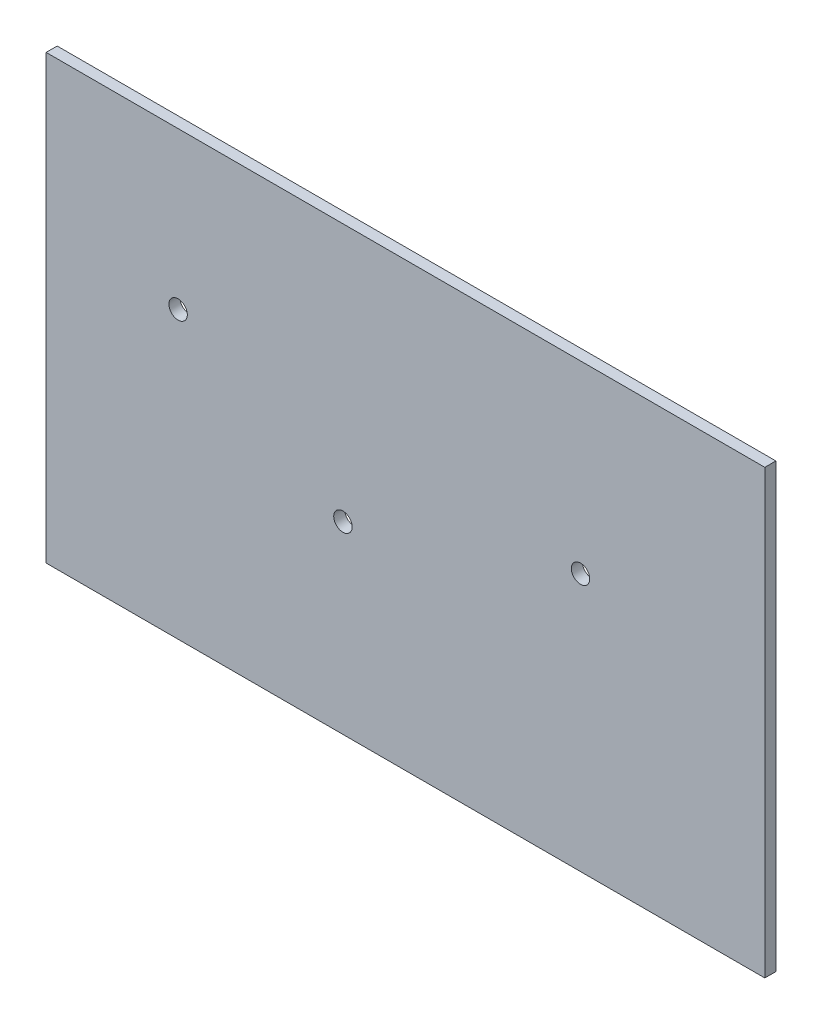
ISO-10303-21;
HEADER;
FILE_DESCRIPTION(('STEP AP214'),'2;1');
FILE_NAME('part.step','',(''),(''),'','','');
FILE_SCHEMA(('AUTOMOTIVE_DESIGN { 1 0 10303 214 1 1 1 1 }'));
ENDSEC;
DATA;
#1=APPLICATION_CONTEXT('core data for automotive mechanical design processes');
#2=APPLICATION_PROTOCOL_DEFINITION('international standard','automotive_design',2000,#1);
#3=PRODUCT_CONTEXT('',#1,'mechanical');
#4=PRODUCT('Part','Part','',(#3));
#5=PRODUCT_RELATED_PRODUCT_CATEGORY('part','',(#4));
#6=PRODUCT_DEFINITION_FORMATION('','',#4);
#7=PRODUCT_DEFINITION_CONTEXT('part definition',#1,'design');
#8=PRODUCT_DEFINITION('design','',#6,#7);
#9=PRODUCT_DEFINITION_SHAPE('','',#8);
#10=(LENGTH_UNIT() NAMED_UNIT(*) SI_UNIT(.MILLI.,.METRE.));
#11=(NAMED_UNIT(*) PLANE_ANGLE_UNIT() SI_UNIT($,.RADIAN.));
#12=(NAMED_UNIT(*) SI_UNIT($,.STERADIAN.) SOLID_ANGLE_UNIT());
#13=UNCERTAINTY_MEASURE_WITH_UNIT(LENGTH_MEASURE(1.E-05),#10,'distance_accuracy_value','');
#14=(GEOMETRIC_REPRESENTATION_CONTEXT(3) GLOBAL_UNCERTAINTY_ASSIGNED_CONTEXT((#13)) GLOBAL_UNIT_ASSIGNED_CONTEXT((#10,
#11,#12)) REPRESENTATION_CONTEXT('',''));
#15=CARTESIAN_POINT('',(0.,0.,0.));
#16=DIRECTION('',(0.,0.,1.));
#17=DIRECTION('',(1.,0.,0.));
#18=AXIS2_PLACEMENT_3D('',#15,#16,#17);
#19=CARTESIAN_POINT('',(-75.7745027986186,50.7636179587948,3.));
#20=DIRECTION('',(1.,0.,0.));
#21=DIRECTION('',(0.,1.,0.));
#22=AXIS2_PLACEMENT_3D('',#19,#20,#21);
#23=PLANE('',#22);
#24=DIRECTION('',(0.,-1.,0.));
#25=VECTOR('',#24,1.);
#26=CARTESIAN_POINT('',(-75.7745027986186,50.7636179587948,0.));
#27=LINE('',#26,#25);
#28=CARTESIAN_POINT('',(-75.7745027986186,50.7636179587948,0.));
#29=VERTEX_POINT('',#28);
#30=CARTESIAN_POINT('',(-75.7745027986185,-69.2363820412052,0.));
#31=VERTEX_POINT('',#30);
#32=EDGE_CURVE('E82',#29,#31,#27,.T.);
#33=ORIENTED_EDGE('',*,*,#32,.T.);
#34=DIRECTION('',(0.,0.,-1.));
#35=VECTOR('',#34,1.);
#36=CARTESIAN_POINT('',(-75.7745027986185,-69.2363820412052,3.));
#37=LINE('',#36,#35);
#38=CARTESIAN_POINT('',(-75.7745027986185,-69.2363820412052,3.));
#39=VERTEX_POINT('',#38);
#40=EDGE_CURVE('E12',#39,#31,#37,.T.);
#41=ORIENTED_EDGE('',*,*,#40,.F.);
#42=DIRECTION('',(0.,-1.,0.));
#43=VECTOR('',#42,1.);
#44=CARTESIAN_POINT('',(-75.7745027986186,50.7636179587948,3.));
#45=LINE('',#44,#43);
#46=CARTESIAN_POINT('',(-75.7745027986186,50.7636179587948,3.));
#47=VERTEX_POINT('',#46);
#48=EDGE_CURVE('E106',#47,#39,#45,.T.);
#49=ORIENTED_EDGE('',*,*,#48,.F.);
#50=DIRECTION('',(0.,0.,-1.));
#51=VECTOR('',#50,1.);
#52=CARTESIAN_POINT('',(-75.7745027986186,50.7636179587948,3.));
#53=LINE('',#52,#51);
#54=EDGE_CURVE('E94',#47,#29,#53,.T.);
#55=ORIENTED_EDGE('',*,*,#54,.T.);
#56=EDGE_LOOP('',(#33,#41,#49,#55));
#57=FACE_BOUND('',#56,.T.);
#58=ADVANCED_FACE('F38',(#57),#23,.F.);
#59=CARTESIAN_POINT('',(-75.7745027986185,-69.2363820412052,3.));
#60=DIRECTION('',(0.,1.,0.));
#61=DIRECTION('',(0.,0.,1.));
#62=AXIS2_PLACEMENT_3D('',#59,#60,#61);
#63=PLANE('',#62);
#64=DIRECTION('',(1.,0.,0.));
#65=VECTOR('',#64,1.);
#66=CARTESIAN_POINT('',(-75.7745027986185,-69.2363820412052,0.));
#67=LINE('',#66,#65);
#68=CARTESIAN_POINT('',(119.225497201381,-69.2363820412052,0.));
#69=VERTEX_POINT('',#68);
#70=EDGE_CURVE('E78',#31,#69,#67,.T.);
#71=ORIENTED_EDGE('',*,*,#70,.T.);
#72=DIRECTION('',(0.,0.,-1.));
#73=VECTOR('',#72,1.);
#74=CARTESIAN_POINT('',(119.225497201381,-69.2363820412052,3.));
#75=LINE('',#74,#73);
#76=CARTESIAN_POINT('',(119.225497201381,-69.2363820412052,3.));
#77=VERTEX_POINT('',#76);
#78=EDGE_CURVE('E45',#77,#69,#75,.T.);
#79=ORIENTED_EDGE('',*,*,#78,.F.);
#80=DIRECTION('',(1.,0.,0.));
#81=VECTOR('',#80,1.);
#82=CARTESIAN_POINT('',(-75.7745027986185,-69.2363820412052,3.));
#83=LINE('',#82,#81);
#84=EDGE_CURVE('E90',#39,#77,#83,.T.);
#85=ORIENTED_EDGE('',*,*,#84,.F.);
#86=ORIENTED_EDGE('',*,*,#40,.T.);
#87=EDGE_LOOP('',(#71,#79,#85,#86));
#88=FACE_BOUND('',#87,.T.);
#89=ADVANCED_FACE('F89',(#88),#63,.F.);
#90=CARTESIAN_POINT('',(119.225497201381,50.7636179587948,3.));
#91=DIRECTION('',(-1.,0.,0.));
#92=DIRECTION('',(0.,-1.,0.));
#93=AXIS2_PLACEMENT_3D('',#90,#91,#92);
#94=PLANE('',#93);
#95=DIRECTION('',(0.,1.,0.));
#96=VECTOR('',#95,1.);
#97=CARTESIAN_POINT('',(119.225497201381,50.7636179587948,0.));
#98=LINE('',#97,#96);
#99=CARTESIAN_POINT('',(119.225497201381,50.7636179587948,0.));
#100=VERTEX_POINT('',#99);
#101=EDGE_CURVE('E83',#69,#100,#98,.T.);
#102=ORIENTED_EDGE('',*,*,#101,.T.);
#103=DIRECTION('',(0.,0.,-1.));
#104=VECTOR('',#103,1.);
#105=CARTESIAN_POINT('',(119.225497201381,50.7636179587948,3.));
#106=LINE('',#105,#104);
#107=CARTESIAN_POINT('',(119.225497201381,50.7636179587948,3.));
#108=VERTEX_POINT('',#107);
#109=EDGE_CURVE('E112',#108,#100,#106,.T.);
#110=ORIENTED_EDGE('',*,*,#109,.F.);
#111=DIRECTION('',(0.,1.,0.));
#112=VECTOR('',#111,1.);
#113=CARTESIAN_POINT('',(119.225497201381,50.7636179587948,3.));
#114=LINE('',#113,#112);
#115=EDGE_CURVE('E57',#77,#108,#114,.T.);
#116=ORIENTED_EDGE('',*,*,#115,.F.);
#117=ORIENTED_EDGE('',*,*,#78,.T.);
#118=EDGE_LOOP('',(#102,#110,#116,#117));
#119=FACE_BOUND('',#118,.T.);
#120=ADVANCED_FACE('F115',(#119),#94,.F.);
#121=CARTESIAN_POINT('',(-75.7745027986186,50.7636179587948,3.));
#122=DIRECTION('',(0.,-1.,0.));
#123=DIRECTION('',(0.,0.,-1.));
#124=AXIS2_PLACEMENT_3D('',#121,#122,#123);
#125=PLANE('',#124);
#126=DIRECTION('',(-1.,0.,0.));
#127=VECTOR('',#126,1.);
#128=CARTESIAN_POINT('',(-75.7745027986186,50.7636179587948,0.));
#129=LINE('',#128,#127);
#130=EDGE_CURVE('E102',#100,#29,#129,.T.);
#131=ORIENTED_EDGE('',*,*,#130,.T.);
#132=ORIENTED_EDGE('',*,*,#54,.F.);
#133=DIRECTION('',(-1.,0.,0.));
#134=VECTOR('',#133,1.);
#135=CARTESIAN_POINT('',(-75.7745027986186,50.7636179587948,3.));
#136=LINE('',#135,#134);
#137=EDGE_CURVE('E52',#108,#47,#136,.T.);
#138=ORIENTED_EDGE('',*,*,#137,.F.);
#139=ORIENTED_EDGE('',*,*,#109,.T.);
#140=EDGE_LOOP('',(#131,#132,#138,#139));
#141=FACE_BOUND('',#140,.T.);
#142=ADVANCED_FACE('F117',(#141),#125,.F.);
#143=CARTESIAN_POINT('',(-75.7745027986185,-69.2363820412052,3.));
#144=DIRECTION('',(0.,0.,1.));
#145=DIRECTION('',(1.,0.,0.));
#146=AXIS2_PLACEMENT_3D('',#143,#144,#145);
#147=PLANE('',#146);
#148=CARTESIAN_POINT('',(-39.9648471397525,8.2636179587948,3.));
#149=DIRECTION('',(0.,0.,1.));
#150=DIRECTION('',(1.,0.,0.));
#151=AXIS2_PLACEMENT_3D('',#148,#149,#150);
#152=CIRCLE('',#151,2.5);
#153=CARTESIAN_POINT('',(-37.4648471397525,8.2636179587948,3.));
#154=VERTEX_POINT('',#153);
#155=EDGE_CURVE('E193',#154,#154,#152,.T.);
#156=ORIENTED_EDGE('',*,*,#155,.F.);
#157=EDGE_LOOP('',(#156));
#158=FACE_BOUND('',#157,.T.);
#159=CARTESIAN_POINT('',(4.75651241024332,-19.2363820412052,3.));
#160=DIRECTION('',(0.,0.,1.));
#161=DIRECTION('',(1.,0.,0.));
#162=AXIS2_PLACEMENT_3D('',#159,#160,#161);
#163=CIRCLE('',#162,2.5);
#164=CARTESIAN_POINT('',(7.25651241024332,-19.2363820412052,3.));
#165=VERTEX_POINT('',#164);
#166=EDGE_CURVE('E195',#165,#165,#163,.T.);
#167=ORIENTED_EDGE('',*,*,#166,.F.);
#168=EDGE_LOOP('',(#167));
#169=FACE_BOUND('',#168,.T.);
#170=CARTESIAN_POINT('',(69.2254972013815,0.763617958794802,3.));
#171=DIRECTION('',(0.,0.,1.));
#172=DIRECTION('',(1.,0.,0.));
#173=AXIS2_PLACEMENT_3D('',#170,#171,#172);
#174=CIRCLE('',#173,2.5);
#175=CARTESIAN_POINT('',(71.7254972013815,0.763617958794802,3.));
#176=VERTEX_POINT('',#175);
#177=EDGE_CURVE('E98',#176,#176,#174,.T.);
#178=ORIENTED_EDGE('',*,*,#177,.F.);
#179=EDGE_LOOP('',(#178));
#180=FACE_BOUND('',#179,.T.);
#181=ORIENTED_EDGE('',*,*,#48,.T.);
#182=ORIENTED_EDGE('',*,*,#84,.T.);
#183=ORIENTED_EDGE('',*,*,#115,.T.);
#184=ORIENTED_EDGE('',*,*,#137,.T.);
#185=EDGE_LOOP('',(#181,#182,#183,#184));
#186=FACE_BOUND('',#185,.T.);
#187=ADVANCED_FACE('F118',(#158,#169,#180,#186),#147,.T.);
#188=CARTESIAN_POINT('',(-75.7745027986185,-69.2363820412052,0.));
#189=DIRECTION('',(0.,0.,1.));
#190=DIRECTION('',(1.,0.,0.));
#191=AXIS2_PLACEMENT_3D('',#188,#189,#190);
#192=PLANE('',#191);
#193=CARTESIAN_POINT('',(-39.9648471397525,8.2636179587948,0.));
#194=DIRECTION('',(0.,0.,1.));
#195=DIRECTION('',(1.,0.,0.));
#196=AXIS2_PLACEMENT_3D('',#193,#194,#195);
#197=CIRCLE('',#196,2.5);
#198=CARTESIAN_POINT('',(-37.4648471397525,8.2636179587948,0.));
#199=VERTEX_POINT('',#198);
#200=EDGE_CURVE('E191',#199,#199,#197,.T.);
#201=ORIENTED_EDGE('',*,*,#200,.T.);
#202=EDGE_LOOP('',(#201));
#203=FACE_BOUND('',#202,.T.);
#204=CARTESIAN_POINT('',(4.75651241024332,-19.2363820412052,0.));
#205=DIRECTION('',(0.,0.,1.));
#206=DIRECTION('',(1.,0.,0.));
#207=AXIS2_PLACEMENT_3D('',#204,#205,#206);
#208=CIRCLE('',#207,2.5);
#209=CARTESIAN_POINT('',(7.25651241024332,-19.2363820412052,0.));
#210=VERTEX_POINT('',#209);
#211=EDGE_CURVE('E200',#210,#210,#208,.T.);
#212=ORIENTED_EDGE('',*,*,#211,.T.);
#213=EDGE_LOOP('',(#212));
#214=FACE_BOUND('',#213,.T.);
#215=CARTESIAN_POINT('',(69.2254972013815,0.763617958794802,0.));
#216=DIRECTION('',(0.,0.,1.));
#217=DIRECTION('',(1.,0.,0.));
#218=AXIS2_PLACEMENT_3D('',#215,#216,#217);
#219=CIRCLE('',#218,2.5);
#220=CARTESIAN_POINT('',(71.7254972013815,0.763617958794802,0.));
#221=VERTEX_POINT('',#220);
#222=EDGE_CURVE('E95',#221,#221,#219,.T.);
#223=ORIENTED_EDGE('',*,*,#222,.T.);
#224=EDGE_LOOP('',(#223));
#225=FACE_BOUND('',#224,.T.);
#226=ORIENTED_EDGE('',*,*,#32,.F.);
#227=ORIENTED_EDGE('',*,*,#130,.F.);
#228=ORIENTED_EDGE('',*,*,#101,.F.);
#229=ORIENTED_EDGE('',*,*,#70,.F.);
#230=EDGE_LOOP('',(#226,#227,#228,#229));
#231=FACE_BOUND('',#230,.T.);
#232=ADVANCED_FACE('F79',(#203,#214,#225,#231),#192,.F.);
#233=CARTESIAN_POINT('',(69.2254972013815,0.763617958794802,0.));
#234=DIRECTION('',(0.,0.,1.));
#235=DIRECTION('',(1.,0.,0.));
#236=AXIS2_PLACEMENT_3D('',#233,#234,#235);
#237=CYLINDRICAL_SURFACE('',#236,2.5);
#238=ORIENTED_EDGE('',*,*,#222,.F.);
#239=EDGE_LOOP('',(#238));
#240=FACE_BOUND('',#239,.T.);
#241=ORIENTED_EDGE('',*,*,#177,.T.);
#242=EDGE_LOOP('',(#241));
#243=FACE_BOUND('',#242,.T.);
#244=ADVANCED_FACE('F126',(#240,#243),#237,.F.);
#245=CARTESIAN_POINT('',(4.75651241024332,-19.2363820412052,0.));
#246=DIRECTION('',(0.,0.,1.));
#247=DIRECTION('',(1.,0.,0.));
#248=AXIS2_PLACEMENT_3D('',#245,#246,#247);
#249=CYLINDRICAL_SURFACE('',#248,2.5);
#250=ORIENTED_EDGE('',*,*,#211,.F.);
#251=EDGE_LOOP('',(#250));
#252=FACE_BOUND('',#251,.T.);
#253=ORIENTED_EDGE('',*,*,#166,.T.);
#254=EDGE_LOOP('',(#253));
#255=FACE_BOUND('',#254,.T.);
#256=ADVANCED_FACE('F160',(#252,#255),#249,.F.);
#257=CARTESIAN_POINT('',(-39.9648471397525,8.2636179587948,0.));
#258=DIRECTION('',(0.,0.,1.));
#259=DIRECTION('',(1.,0.,0.));
#260=AXIS2_PLACEMENT_3D('',#257,#258,#259);
#261=CYLINDRICAL_SURFACE('',#260,2.5);
#262=ORIENTED_EDGE('',*,*,#200,.F.);
#263=EDGE_LOOP('',(#262));
#264=FACE_BOUND('',#263,.T.);
#265=ORIENTED_EDGE('',*,*,#155,.T.);
#266=EDGE_LOOP('',(#265));
#267=FACE_BOUND('',#266,.T.);
#268=ADVANCED_FACE('F170',(#264,#267),#261,.F.);
#269=CLOSED_SHELL('',(#58,#89,#120,#142,#187,#232,#244,#256,#268));
#270=MANIFOLD_SOLID_BREP('B2',#269);
#271=ADVANCED_BREP_SHAPE_REPRESENTATION('',(#18,#270),#14);
#272=SHAPE_DEFINITION_REPRESENTATION(#9,#271);
ENDSEC;
END-ISO-10303-21;
